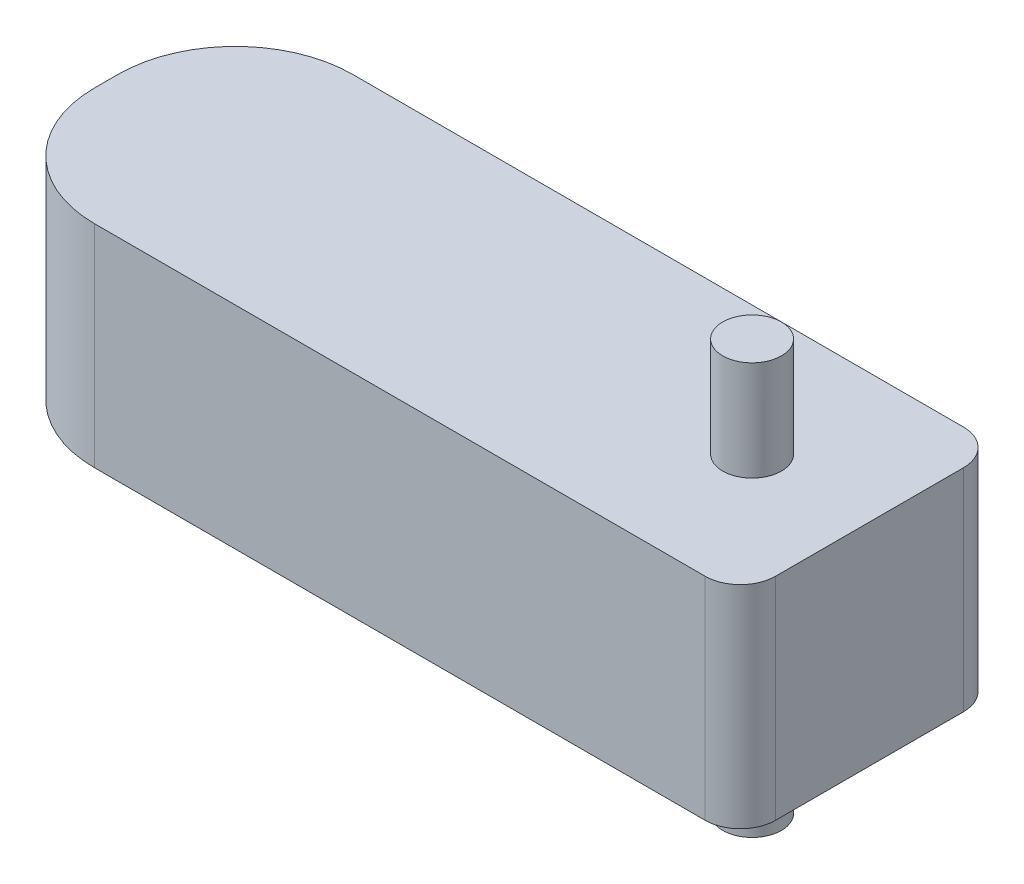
from build123d import *

# Parameters (mm, degrees)
SKETCH2_W           = 65
SKETCH2_H           = 22
BOSS_EXTRUDE1_DEPTH = 18
SKETCH3_R           = 2.5
BOSS_EXTRUDE2_DEPTH = 8.5
BOSS_EXTRUDE3_START = 8.5
SKETCH4_R           = 2.5
BOSS_EXTRUDE3_DEPTH = 8.5
FILLET1_R           = 10
FILLET2_R           = 3


with BuildPart() as part:
    # Sketch2 → Boss-Extrude1 (new body)
    with BuildSketch(Plane(origin=(0, 0, 0), x_dir=(1, 0, 0), z_dir=(0, 1, 0))):
        with Locations((32.5, 11)):
            Rectangle(SKETCH2_W, SKETCH2_H)
    extrude(amount=BOSS_EXTRUDE1_DEPTH)

    # Sketch3 → Boss-Extrude2 (add)
    with BuildSketch(Plane(origin=(0, 18, 0), x_dir=(1, 0, 0), z_dir=(0, 1, 0))):
        with Locations(Location((55, 11, 0), (0, 0, 90))):
            Circle(SKETCH3_R)
    extrude(amount=BOSS_EXTRUDE2_DEPTH)

    # Sketch4 → Boss-Extrude3 (add)
    with BuildSketch(Plane.XZ.offset(BOSS_EXTRUDE3_START)):
        with Locations(Location((55, -11, 0), (0, 0, 270))):
            Circle(SKETCH4_R)
    extrude(amount=-BOSS_EXTRUDE3_DEPTH)

    # Fillet1
    fillet1_edges = [part.edges().sort_by_distance(p)[0] for p in [
        (0, 9, -22),
        (0, 9, 0),
    ]]
    fillet(fillet1_edges, radius=FILLET1_R)

    # Fillet2
    fillet2_edges = [part.edges().sort_by_distance(p)[0] for p in [
        (65, 9, -22),
        (65, 9, 0),
    ]]
    fillet(fillet2_edges, radius=FILLET2_R)


solid = part.part
